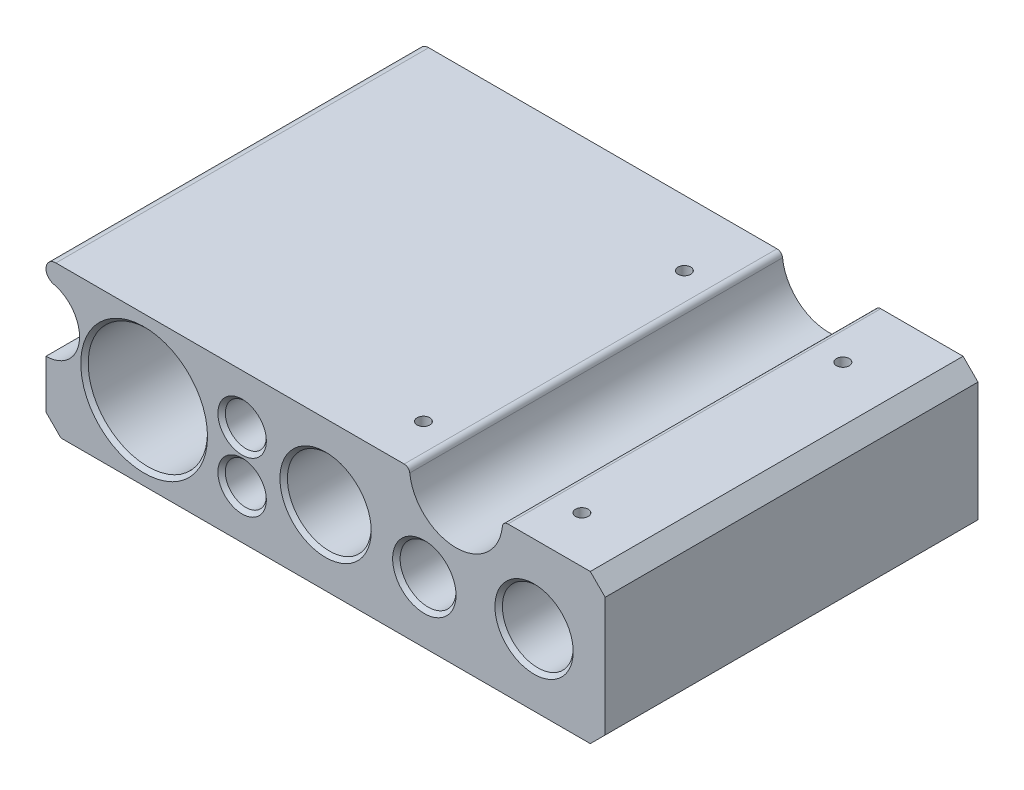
ISO-10303-21;
HEADER;
FILE_DESCRIPTION(('STEP AP214'),'2;1');
FILE_NAME('part.step','',(''),(''),'','','');
FILE_SCHEMA(('AUTOMOTIVE_DESIGN { 1 0 10303 214 1 1 1 1 }'));
ENDSEC;
DATA;
#1=APPLICATION_CONTEXT('core data for automotive mechanical design processes');
#2=APPLICATION_PROTOCOL_DEFINITION('international standard','automotive_design',2000,#1);
#3=PRODUCT_CONTEXT('',#1,'mechanical');
#4=PRODUCT('Part','Part','',(#3));
#5=PRODUCT_RELATED_PRODUCT_CATEGORY('part','',(#4));
#6=PRODUCT_DEFINITION_FORMATION('','',#4);
#7=PRODUCT_DEFINITION_CONTEXT('part definition',#1,'design');
#8=PRODUCT_DEFINITION('design','',#6,#7);
#9=PRODUCT_DEFINITION_SHAPE('','',#8);
#10=(LENGTH_UNIT() NAMED_UNIT(*) SI_UNIT(.MILLI.,.METRE.));
#11=(NAMED_UNIT(*) PLANE_ANGLE_UNIT() SI_UNIT($,.RADIAN.));
#12=(NAMED_UNIT(*) SI_UNIT($,.STERADIAN.) SOLID_ANGLE_UNIT());
#13=UNCERTAINTY_MEASURE_WITH_UNIT(LENGTH_MEASURE(1.E-05),#10,'distance_accuracy_value','');
#14=(GEOMETRIC_REPRESENTATION_CONTEXT(3) GLOBAL_UNCERTAINTY_ASSIGNED_CONTEXT((#13)) GLOBAL_UNIT_ASSIGNED_CONTEXT((#10,
#11,#12)) REPRESENTATION_CONTEXT('',''));
#15=CARTESIAN_POINT('',(0.,0.,0.));
#16=DIRECTION('',(0.,0.,1.));
#17=DIRECTION('',(1.,0.,0.));
#18=AXIS2_PLACEMENT_3D('',#15,#16,#17);
#19=CARTESIAN_POINT('',(-145.901987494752,29.5273013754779,120.));
#20=CARTESIAN_POINT('',(-145.901987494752,29.5273013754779,113.333333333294));
#21=CARTESIAN_POINT('',(-145.901987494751,29.5273013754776,106.66666666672));
#22=CARTESIAN_POINT('',(-145.901987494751,29.5273013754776,33.333333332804));
#23=CARTESIAN_POINT('',(-145.901987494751,29.5273013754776,-33.3333333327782));
#24=CARTESIAN_POINT('',(-145.901987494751,29.5273013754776,-106.666666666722));
#25=CARTESIAN_POINT('',(-145.901987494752,29.5273013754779,-113.333333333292));
#26=CARTESIAN_POINT('',(-145.901987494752,29.5273013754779,-120.));
#27=CARTESIAN_POINT('',(-154.2533414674,31.479909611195,120.));
#28=CARTESIAN_POINT('',(-154.2533414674,31.479909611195,113.333333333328));
#29=CARTESIAN_POINT('',(-154.253341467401,31.4799096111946,106.666666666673));
#30=CARTESIAN_POINT('',(-154.253341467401,31.4799096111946,33.3333333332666));
#31=CARTESIAN_POINT('',(-154.253341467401,31.4799096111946,-33.3333333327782));
#32=CARTESIAN_POINT('',(-154.253341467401,31.4799096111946,-106.666666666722));
#33=CARTESIAN_POINT('',(-154.2533414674,31.479909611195,-113.333333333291));
#34=CARTESIAN_POINT('',(-154.2533414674,31.479909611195,-120.));
#35=CARTESIAN_POINT('',(-153.270563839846,40.0000000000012,120.));
#36=CARTESIAN_POINT('',(-153.270563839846,40.0000000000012,113.333333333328));
#37=CARTESIAN_POINT('',(-153.270563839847,40.000000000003,106.666666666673));
#38=CARTESIAN_POINT('',(-153.270563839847,40.000000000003,33.3333333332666));
#39=CARTESIAN_POINT('',(-153.270563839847,40.000000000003,-33.3333333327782));
#40=CARTESIAN_POINT('',(-153.270563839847,40.000000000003,-106.666666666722));
#41=CARTESIAN_POINT('',(-153.270563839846,40.0000000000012,-113.333333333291));
#42=CARTESIAN_POINT('',(-153.270563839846,40.0000000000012,-120.));
#43=CARTESIAN_POINT('',(-144.69397989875,40.,120.));
#44=CARTESIAN_POINT('',(-144.69397989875,40.,113.333333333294));
#45=CARTESIAN_POINT('',(-144.693979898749,40.,106.66666666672));
#46=CARTESIAN_POINT('',(-144.693979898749,40.,33.333333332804));
#47=CARTESIAN_POINT('',(-144.693979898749,40.,-33.3333333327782));
#48=CARTESIAN_POINT('',(-144.693979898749,40.,-106.666666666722));
#49=CARTESIAN_POINT('',(-144.69397989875,40.,-113.333333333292));
#50=CARTESIAN_POINT('',(-144.69397989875,40.,-120.));
#51=(BOUNDED_SURFACE() B_SPLINE_SURFACE(3,3,((#19,#20,#21,#22,#23,#24,#25,#26),(#27,#28,#29,#30,
#31,#32,#33,#34),(#35,#36,#37,#38,#39,#40,#41,#42),(#43,#44,#45,#46,#47,#48,#49,#50)),
.UNSPECIFIED.,.F.,.F.,.F.) B_SPLINE_SURFACE_WITH_KNOTS((4,4),(4,2,2,4),(0.,1.),(-0.1,0.,1.,1.1),
.UNSPECIFIED.) GEOMETRIC_REPRESENTATION_ITEM() RATIONAL_B_SPLINE_SURFACE(((1.,1.,1.,1.,1.,1.,1.,
1.),(0.409725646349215,0.409725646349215,0.409725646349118,0.409725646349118,0.409725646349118,
0.409725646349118,0.409725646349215,0.409725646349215),(0.409725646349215,0.409725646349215,
0.409725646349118,0.409725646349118,0.409725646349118,0.409725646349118,0.409725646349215,
0.409725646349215),(1.,1.,1.,1.,1.,1.,1.,1.))) REPRESENTATION_ITEM('') SURFACE());
#52=CARTESIAN_POINT('',(-145.901987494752,29.5273013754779,-120.));
#53=CARTESIAN_POINT('',(-145.901987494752,29.5273013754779,-113.333333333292));
#54=CARTESIAN_POINT('',(-145.901987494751,29.5273013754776,-106.666666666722));
#55=CARTESIAN_POINT('',(-145.901987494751,29.5273013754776,-33.3333333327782));
#56=CARTESIAN_POINT('',(-145.901987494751,29.5273013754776,33.333333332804));
#57=CARTESIAN_POINT('',(-145.901987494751,29.5273013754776,106.66666666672));
#58=CARTESIAN_POINT('',(-145.901987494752,29.5273013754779,113.333333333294));
#59=CARTESIAN_POINT('',(-145.901987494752,29.5273013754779,120.));
#60=(BOUNDED_CURVE() B_SPLINE_CURVE(3,(#52,#53,#54,#55,#56,#57,#58,#59),.UNSPECIFIED.,.F.,
.F.) B_SPLINE_CURVE_WITH_KNOTS((4,2,2,4),(-0.1,0.,1.,1.1),
.UNSPECIFIED.) CURVE() GEOMETRIC_REPRESENTATION_ITEM() RATIONAL_B_SPLINE_CURVE((1.,1.,1.,1.,1.,
1.,1.,1.)) REPRESENTATION_ITEM(''));
#61=CARTESIAN_POINT('',(-145.901987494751,29.5273013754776,100.));
#62=VERTEX_POINT('',#61);
#63=CARTESIAN_POINT('',(-145.901987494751,29.5273013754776,-100.));
#64=VERTEX_POINT('',#63);
#65=EDGE_CURVE('E251',#62,#64,#60,.F.);
#66=CARTESIAN_POINT('',(-145.901987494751,29.5273013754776,100.));
#67=CARTESIAN_POINT('',(-154.253341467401,31.4799096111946,100.));
#68=CARTESIAN_POINT('',(-153.270563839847,40.000000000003,100.));
#69=CARTESIAN_POINT('',(-144.693979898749,40.,100.));
#70=(BOUNDED_CURVE() B_SPLINE_CURVE(3,(#66,#67,#68,#69),.UNSPECIFIED.,.F.,
.F.) B_SPLINE_CURVE_WITH_KNOTS((4,4),(0.,1.),
.UNSPECIFIED.) CURVE() GEOMETRIC_REPRESENTATION_ITEM() RATIONAL_B_SPLINE_CURVE((1.,
0.409725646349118,0.409725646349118,1.)) REPRESENTATION_ITEM(''));
#71=CARTESIAN_POINT('',(-144.693979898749,40.,100.));
#72=VERTEX_POINT('',#71);
#73=EDGE_CURVE('E287',#72,#62,#70,.F.);
#74=CARTESIAN_POINT('',(-144.69397989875,40.,120.));
#75=CARTESIAN_POINT('',(-144.69397989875,40.,113.333333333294));
#76=CARTESIAN_POINT('',(-144.693979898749,40.,106.66666666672));
#77=CARTESIAN_POINT('',(-144.693979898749,40.,33.333333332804));
#78=CARTESIAN_POINT('',(-144.693979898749,40.,-33.3333333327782));
#79=CARTESIAN_POINT('',(-144.693979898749,40.,-106.666666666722));
#80=CARTESIAN_POINT('',(-144.69397989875,40.,-113.333333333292));
#81=CARTESIAN_POINT('',(-144.69397989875,40.,-120.));
#82=(BOUNDED_CURVE() B_SPLINE_CURVE(3,(#74,#75,#76,#77,#78,#79,#80,#81),.UNSPECIFIED.,.F.,
.F.) B_SPLINE_CURVE_WITH_KNOTS((4,2,2,4),(-0.1,0.,1.,1.1),
.UNSPECIFIED.) CURVE() GEOMETRIC_REPRESENTATION_ITEM() RATIONAL_B_SPLINE_CURVE((1.,1.,1.,1.,1.,
1.,1.,1.)) REPRESENTATION_ITEM(''));
#83=CARTESIAN_POINT('',(-144.693979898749,40.,-100.));
#84=VERTEX_POINT('',#83);
#85=EDGE_CURVE('E506',#84,#72,#82,.F.);
#86=CARTESIAN_POINT('',(-144.693979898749,40.,-100.));
#87=CARTESIAN_POINT('',(-153.270563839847,40.000000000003,-100.));
#88=CARTESIAN_POINT('',(-154.253341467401,31.4799096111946,-100.));
#89=CARTESIAN_POINT('',(-145.901987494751,29.5273013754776,-100.));
#90=(BOUNDED_CURVE() B_SPLINE_CURVE(3,(#86,#87,#88,#89),.UNSPECIFIED.,.F.,
.F.) B_SPLINE_CURVE_WITH_KNOTS((4,4),(0.,1.),
.UNSPECIFIED.) CURVE() GEOMETRIC_REPRESENTATION_ITEM() RATIONAL_B_SPLINE_CURVE((1.,
0.409725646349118,0.409725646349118,1.)) REPRESENTATION_ITEM(''));
#91=EDGE_CURVE('E362',#64,#84,#90,.F.);
#92=ORIENTED_EDGE('',*,*,#65,.F.);
#93=ORIENTED_EDGE('',*,*,#73,.F.);
#94=ORIENTED_EDGE('',*,*,#85,.F.);
#95=ORIENTED_EDGE('',*,*,#91,.F.);
#96=EDGE_LOOP('',(#92,#93,#94,#95));
#97=FACE_BOUND('',#96,.T.);
#98=ADVANCED_FACE('F43',(#97),#51,.T.);
#99=CARTESIAN_POINT('',(-150.,12.,100.));
#100=DIRECTION('',(0.,0.,1.));
#101=DIRECTION('',(1.,0.,0.));
#102=AXIS2_PLACEMENT_3D('',#99,#100,#101);
#103=PLANE('',#102);
#104=CARTESIAN_POINT('',(111.835569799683,-1.8355697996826,100.));
#105=DIRECTION('',(0.,0.,1.));
#106=DIRECTION('',(1.,0.,0.));
#107=AXIS2_PLACEMENT_3D('',#104,#105,#106);
#108=CIRCLE('',#107,21.);
#109=CARTESIAN_POINT('',(132.835569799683,-1.8355697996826,100.));
#110=VERTEX_POINT('',#109);
#111=EDGE_CURVE('E438',#110,#110,#108,.F.);
#112=ORIENTED_EDGE('',*,*,#111,.T.);
#113=EDGE_LOOP('',(#112));
#114=FACE_BOUND('',#113,.T.);
#115=CARTESIAN_POINT('',(52.9669446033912,-7.06407255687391,100.));
#116=DIRECTION('',(0.,0.,1.));
#117=DIRECTION('',(1.,0.,0.));
#118=AXIS2_PLACEMENT_3D('',#115,#116,#117);
#119=CIRCLE('',#118,17.0000000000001);
#120=CARTESIAN_POINT('',(69.9669446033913,-7.06407255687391,100.));
#121=VERTEX_POINT('',#120);
#122=EDGE_CURVE('E435',#121,#121,#119,.F.);
#123=ORIENTED_EDGE('',*,*,#122,.T.);
#124=EDGE_LOOP('',(#123));
#125=FACE_BOUND('',#124,.T.);
#126=CARTESIAN_POINT('',(0.,0.,100.));
#127=DIRECTION('',(0.,0.,1.));
#128=DIRECTION('',(1.,0.,0.));
#129=AXIS2_PLACEMENT_3D('',#126,#127,#128);
#130=CIRCLE('',#129,24.5);
#131=CARTESIAN_POINT('',(24.4999999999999,0.,100.));
#132=VERTEX_POINT('',#131);
#133=EDGE_CURVE('E432',#132,#132,#130,.F.);
#134=ORIENTED_EDGE('',*,*,#133,.T.);
#135=EDGE_LOOP('',(#134));
#136=FACE_BOUND('',#135,.T.);
#137=CARTESIAN_POINT('',(-44.7790012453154,13.678438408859,100.));
#138=DIRECTION('',(0.,0.,1.));
#139=DIRECTION('',(1.,0.,0.));
#140=AXIS2_PLACEMENT_3D('',#137,#138,#139);
#141=CIRCLE('',#140,13.);
#142=CARTESIAN_POINT('',(-31.7790012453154,13.678438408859,100.));
#143=VERTEX_POINT('',#142);
#144=EDGE_CURVE('E429',#143,#143,#141,.F.);
#145=ORIENTED_EDGE('',*,*,#144,.T.);
#146=EDGE_LOOP('',(#145));
#147=FACE_BOUND('',#146,.T.);
#148=CARTESIAN_POINT('',(-44.7790012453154,-13.6784384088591,100.));
#149=DIRECTION('',(0.,0.,1.));
#150=DIRECTION('',(1.,0.,0.));
#151=AXIS2_PLACEMENT_3D('',#148,#149,#150);
#152=CIRCLE('',#151,13.);
#153=CARTESIAN_POINT('',(-31.7790012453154,-13.6784384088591,100.));
#154=VERTEX_POINT('',#153);
#155=EDGE_CURVE('E426',#154,#154,#152,.F.);
#156=ORIENTED_EDGE('',*,*,#155,.T.);
#157=EDGE_LOOP('',(#156));
#158=FACE_BOUND('',#157,.T.);
#159=CARTESIAN_POINT('',(-97.3502136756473,0.,100.));
#160=DIRECTION('',(0.,0.,1.));
#161=DIRECTION('',(1.,0.,0.));
#162=AXIS2_PLACEMENT_3D('',#159,#160,#161);
#163=CIRCLE('',#162,34.0000000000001);
#164=CARTESIAN_POINT('',(-63.3502136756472,0.,100.));
#165=VERTEX_POINT('',#164);
#166=EDGE_CURVE('E423',#165,#165,#163,.F.);
#167=ORIENTED_EDGE('',*,*,#166,.T.);
#168=EDGE_LOOP('',(#167));
#169=FACE_BOUND('',#168,.T.);
#170=DIRECTION('',(-1.,0.,0.));
#171=VECTOR('',#170,1.);
#172=CARTESIAN_POINT('',(95.,40.,100.));
#173=LINE('',#172,#171);
#174=CARTESIAN_POINT('',(142.,40.,100.));
#175=VERTEX_POINT('',#174);
#176=CARTESIAN_POINT('',(97.8388218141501,40.,100.));
#177=VERTEX_POINT('',#176);
#178=EDGE_CURVE('E188',#175,#177,#173,.T.);
#179=ORIENTED_EDGE('',*,*,#178,.T.);
#180=CARTESIAN_POINT('',(97.8388218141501,37.,100.));
#181=DIRECTION('',(0.,0.,1.));
#182=DIRECTION('',(1.,0.,0.));
#183=AXIS2_PLACEMENT_3D('',#180,#181,#182);
#184=CIRCLE('',#183,3.);
#185=CARTESIAN_POINT('',(94.8560909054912,37.3214285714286,100.));
#186=VERTEX_POINT('',#185);
#187=EDGE_CURVE('E51',#177,#186,#184,.T.);
#188=ORIENTED_EDGE('',*,*,#187,.T.);
#189=CARTESIAN_POINT('',(70.,40.,100.));
#190=DIRECTION('',(0.,0.,-1.));
#191=DIRECTION('',(1.,0.,0.));
#192=AXIS2_PLACEMENT_3D('',#189,#190,#191);
#193=CIRCLE('',#192,25.);
#194=CARTESIAN_POINT('',(45.1439090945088,37.3214285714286,100.));
#195=VERTEX_POINT('',#194);
#196=EDGE_CURVE('E191',#186,#195,#193,.T.);
#197=ORIENTED_EDGE('',*,*,#196,.T.);
#198=CARTESIAN_POINT('',(42.1611781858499,37.,100.));
#199=DIRECTION('',(0.,0.,1.));
#200=DIRECTION('',(1.,0.,0.));
#201=AXIS2_PLACEMENT_3D('',#198,#199,#200);
#202=CIRCLE('',#201,3.);
#203=CARTESIAN_POINT('',(42.1611781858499,40.,100.));
#204=VERTEX_POINT('',#203);
#205=EDGE_CURVE('E58',#195,#204,#202,.T.);
#206=ORIENTED_EDGE('',*,*,#205,.T.);
#207=DIRECTION('',(-1.,0.,0.));
#208=VECTOR('',#207,1.);
#209=CARTESIAN_POINT('',(-150.,40.,100.));
#210=LINE('',#209,#208);
#211=EDGE_CURVE('E193',#204,#72,#210,.T.);
#212=ORIENTED_EDGE('',*,*,#211,.T.);
#213=ORIENTED_EDGE('',*,*,#73,.T.);
#214=CARTESIAN_POINT('',(-150.,12.,100.));
#215=DIRECTION('',(0.,0.,-1.));
#216=DIRECTION('',(1.,0.,0.));
#217=AXIS2_PLACEMENT_3D('',#214,#215,#216);
#218=CIRCLE('',#217,18.);
#219=CARTESIAN_POINT('',(-150.,-5.99999999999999,100.));
#220=VERTEX_POINT('',#219);
#221=EDGE_CURVE('E201',#62,#220,#218,.T.);
#222=ORIENTED_EDGE('',*,*,#221,.T.);
#223=DIRECTION('',(0.,-1.,0.));
#224=VECTOR('',#223,1.);
#225=CARTESIAN_POINT('',(-150.,-5.99999999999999,100.));
#226=LINE('',#225,#224);
#227=CARTESIAN_POINT('',(-150.,-31.9999999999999,100.));
#228=VERTEX_POINT('',#227);
#229=EDGE_CURVE('E245',#220,#228,#226,.T.);
#230=ORIENTED_EDGE('',*,*,#229,.T.);
#231=DIRECTION('',(-0.707106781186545,0.70710678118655,0.));
#232=VECTOR('',#231,1.);
#233=CARTESIAN_POINT('',(-172.,-9.99999999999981,100.));
#234=LINE('',#233,#232);
#235=CARTESIAN_POINT('',(-142.,-40.,100.));
#236=VERTEX_POINT('',#235);
#237=EDGE_CURVE('E388',#228,#236,#234,.F.);
#238=ORIENTED_EDGE('',*,*,#237,.T.);
#239=DIRECTION('',(1.,0.,0.));
#240=VECTOR('',#239,1.);
#241=CARTESIAN_POINT('',(-150.,-40.,100.));
#242=LINE('',#241,#240);
#243=CARTESIAN_POINT('',(142.,-40.,100.));
#244=VERTEX_POINT('',#243);
#245=EDGE_CURVE('E487',#236,#244,#242,.T.);
#246=ORIENTED_EDGE('',*,*,#245,.T.);
#247=DIRECTION('',(-0.70710678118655,-0.707106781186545,0.));
#248=VECTOR('',#247,1.);
#249=CARTESIAN_POINT('',(21.999999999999,-160.,100.));
#250=LINE('',#249,#248);
#251=CARTESIAN_POINT('',(150.,-32.,100.));
#252=VERTEX_POINT('',#251);
#253=EDGE_CURVE('E386',#244,#252,#250,.F.);
#254=ORIENTED_EDGE('',*,*,#253,.T.);
#255=DIRECTION('',(0.,1.,0.));
#256=VECTOR('',#255,1.);
#257=CARTESIAN_POINT('',(150.,40.,100.));
#258=LINE('',#257,#256);
#259=CARTESIAN_POINT('',(150.,31.9999999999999,100.));
#260=VERTEX_POINT('',#259);
#261=EDGE_CURVE('E185',#252,#260,#258,.T.);
#262=ORIENTED_EDGE('',*,*,#261,.T.);
#263=DIRECTION('',(0.707106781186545,-0.70710678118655,0.));
#264=VECTOR('',#263,1.);
#265=CARTESIAN_POINT('',(10.000000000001,172.,100.));
#266=LINE('',#265,#264);
#267=EDGE_CURVE('E384',#260,#175,#266,.F.);
#268=ORIENTED_EDGE('',*,*,#267,.T.);
#269=EDGE_LOOP('',(#179,#188,#197,#206,#212,#213,#222,#230,#238,#246,#254,#262,#268));
#270=FACE_BOUND('',#269,.T.);
#271=ADVANCED_FACE('F205',(#114,#125,#136,#147,#158,#169,#270),#103,.T.);
#272=CARTESIAN_POINT('',(-150.,12.,-100.));
#273=DIRECTION('',(0.,0.,1.));
#274=DIRECTION('',(1.,0.,0.));
#275=AXIS2_PLACEMENT_3D('',#272,#273,#274);
#276=PLANE('',#275);
#277=CARTESIAN_POINT('',(111.835569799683,-1.8355697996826,-100.));
#278=DIRECTION('',(0.,0.,1.));
#279=DIRECTION('',(1.,0.,0.));
#280=AXIS2_PLACEMENT_3D('',#277,#278,#279);
#281=CIRCLE('',#280,21.);
#282=CARTESIAN_POINT('',(132.835569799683,-1.8355697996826,-100.));
#283=VERTEX_POINT('',#282);
#284=EDGE_CURVE('E414',#283,#283,#281,.T.);
#285=ORIENTED_EDGE('',*,*,#284,.T.);
#286=EDGE_LOOP('',(#285));
#287=FACE_BOUND('',#286,.T.);
#288=CARTESIAN_POINT('',(52.9669446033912,-7.06407255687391,-100.));
#289=DIRECTION('',(0.,0.,1.));
#290=DIRECTION('',(1.,0.,0.));
#291=AXIS2_PLACEMENT_3D('',#288,#289,#290);
#292=CIRCLE('',#291,16.9999999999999);
#293=CARTESIAN_POINT('',(69.9669446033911,-7.06407255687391,-100.));
#294=VERTEX_POINT('',#293);
#295=EDGE_CURVE('E410',#294,#294,#292,.T.);
#296=ORIENTED_EDGE('',*,*,#295,.T.);
#297=EDGE_LOOP('',(#296));
#298=FACE_BOUND('',#297,.T.);
#299=CARTESIAN_POINT('',(0.,0.,-100.));
#300=DIRECTION('',(0.,0.,1.));
#301=DIRECTION('',(1.,0.,0.));
#302=AXIS2_PLACEMENT_3D('',#299,#300,#301);
#303=CIRCLE('',#302,24.5);
#304=CARTESIAN_POINT('',(24.5,0.,-100.));
#305=VERTEX_POINT('',#304);
#306=EDGE_CURVE('E407',#305,#305,#303,.T.);
#307=ORIENTED_EDGE('',*,*,#306,.T.);
#308=EDGE_LOOP('',(#307));
#309=FACE_BOUND('',#308,.T.);
#310=CARTESIAN_POINT('',(-44.7790012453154,13.678438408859,-100.));
#311=DIRECTION('',(0.,0.,1.));
#312=DIRECTION('',(1.,0.,0.));
#313=AXIS2_PLACEMENT_3D('',#310,#311,#312);
#314=CIRCLE('',#313,13.);
#315=CARTESIAN_POINT('',(-31.7790012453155,13.678438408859,-100.));
#316=VERTEX_POINT('',#315);
#317=EDGE_CURVE('E404',#316,#316,#314,.T.);
#318=ORIENTED_EDGE('',*,*,#317,.T.);
#319=EDGE_LOOP('',(#318));
#320=FACE_BOUND('',#319,.T.);
#321=CARTESIAN_POINT('',(-44.7790012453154,-13.6784384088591,-100.));
#322=DIRECTION('',(0.,0.,1.));
#323=DIRECTION('',(1.,0.,0.));
#324=AXIS2_PLACEMENT_3D('',#321,#322,#323);
#325=CIRCLE('',#324,13.);
#326=CARTESIAN_POINT('',(-31.7790012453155,-13.6784384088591,-100.));
#327=VERTEX_POINT('',#326);
#328=EDGE_CURVE('E401',#327,#327,#325,.T.);
#329=ORIENTED_EDGE('',*,*,#328,.T.);
#330=EDGE_LOOP('',(#329));
#331=FACE_BOUND('',#330,.T.);
#332=CARTESIAN_POINT('',(-97.3502136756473,0.,-100.));
#333=DIRECTION('',(0.,0.,1.));
#334=DIRECTION('',(1.,0.,0.));
#335=AXIS2_PLACEMENT_3D('',#332,#333,#334);
#336=CIRCLE('',#335,34.);
#337=CARTESIAN_POINT('',(-63.3502136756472,0.,-100.));
#338=VERTEX_POINT('',#337);
#339=EDGE_CURVE('E398',#338,#338,#336,.T.);
#340=ORIENTED_EDGE('',*,*,#339,.T.);
#341=EDGE_LOOP('',(#340));
#342=FACE_BOUND('',#341,.T.);
#343=CARTESIAN_POINT('',(70.,40.,-100.));
#344=DIRECTION('',(0.,0.,-1.));
#345=DIRECTION('',(1.,0.,0.));
#346=AXIS2_PLACEMENT_3D('',#343,#344,#345);
#347=CIRCLE('',#346,25.);
#348=CARTESIAN_POINT('',(94.8560909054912,37.3214285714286,-100.));
#349=VERTEX_POINT('',#348);
#350=CARTESIAN_POINT('',(45.1439090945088,37.3214285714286,-100.));
#351=VERTEX_POINT('',#350);
#352=EDGE_CURVE('E231',#349,#351,#347,.T.);
#353=ORIENTED_EDGE('',*,*,#352,.F.);
#354=CARTESIAN_POINT('',(97.8388218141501,37.,-100.));
#355=DIRECTION('',(0.,0.,1.));
#356=DIRECTION('',(1.,0.,0.));
#357=AXIS2_PLACEMENT_3D('',#354,#355,#356);
#358=CIRCLE('',#357,3.);
#359=CARTESIAN_POINT('',(97.8388218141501,40.,-100.));
#360=VERTEX_POINT('',#359);
#361=EDGE_CURVE('E217',#349,#360,#358,.F.);
#362=ORIENTED_EDGE('',*,*,#361,.T.);
#363=DIRECTION('',(-1.,0.,0.));
#364=VECTOR('',#363,1.);
#365=CARTESIAN_POINT('',(95.,40.,-100.));
#366=LINE('',#365,#364);
#367=CARTESIAN_POINT('',(142.,40.,-100.));
#368=VERTEX_POINT('',#367);
#369=EDGE_CURVE('E483',#368,#360,#366,.T.);
#370=ORIENTED_EDGE('',*,*,#369,.F.);
#371=DIRECTION('',(-0.707106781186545,0.70710678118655,0.));
#372=VECTOR('',#371,1.);
#373=CARTESIAN_POINT('',(142.,40.,-100.));
#374=LINE('',#373,#372);
#375=CARTESIAN_POINT('',(150.,31.9999999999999,-100.));
#376=VERTEX_POINT('',#375);
#377=EDGE_CURVE('E376',#368,#376,#374,.F.);
#378=ORIENTED_EDGE('',*,*,#377,.T.);
#379=DIRECTION('',(0.,1.,0.));
#380=VECTOR('',#379,1.);
#381=CARTESIAN_POINT('',(150.,40.,-100.));
#382=LINE('',#381,#380);
#383=CARTESIAN_POINT('',(150.,-32.,-100.));
#384=VERTEX_POINT('',#383);
#385=EDGE_CURVE('E184',#384,#376,#382,.T.);
#386=ORIENTED_EDGE('',*,*,#385,.F.);
#387=DIRECTION('',(0.70710678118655,0.707106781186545,0.));
#388=VECTOR('',#387,1.);
#389=CARTESIAN_POINT('',(150.,-32.,-100.));
#390=LINE('',#389,#388);
#391=CARTESIAN_POINT('',(142.,-40.,-100.));
#392=VERTEX_POINT('',#391);
#393=EDGE_CURVE('E378',#384,#392,#390,.F.);
#394=ORIENTED_EDGE('',*,*,#393,.T.);
#395=DIRECTION('',(1.,0.,0.));
#396=VECTOR('',#395,1.);
#397=CARTESIAN_POINT('',(-150.,-40.,-100.));
#398=LINE('',#397,#396);
#399=CARTESIAN_POINT('',(-142.,-40.,-100.));
#400=VERTEX_POINT('',#399);
#401=EDGE_CURVE('E189',#400,#392,#398,.T.);
#402=ORIENTED_EDGE('',*,*,#401,.F.);
#403=DIRECTION('',(0.707106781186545,-0.70710678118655,0.));
#404=VECTOR('',#403,1.);
#405=CARTESIAN_POINT('',(-142.,-40.,-100.));
#406=LINE('',#405,#404);
#407=CARTESIAN_POINT('',(-150.,-31.9999999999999,-100.));
#408=VERTEX_POINT('',#407);
#409=EDGE_CURVE('E380',#400,#408,#406,.F.);
#410=ORIENTED_EDGE('',*,*,#409,.T.);
#411=DIRECTION('',(0.,-1.,0.));
#412=VECTOR('',#411,1.);
#413=CARTESIAN_POINT('',(-150.,-5.99999999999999,-100.));
#414=LINE('',#413,#412);
#415=CARTESIAN_POINT('',(-150.,-5.99999999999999,-100.));
#416=VERTEX_POINT('',#415);
#417=EDGE_CURVE('E238',#416,#408,#414,.T.);
#418=ORIENTED_EDGE('',*,*,#417,.F.);
#419=CARTESIAN_POINT('',(-150.,12.,-100.));
#420=DIRECTION('',(0.,0.,-1.));
#421=DIRECTION('',(1.,0.,0.));
#422=AXIS2_PLACEMENT_3D('',#419,#420,#421);
#423=CIRCLE('',#422,18.);
#424=EDGE_CURVE('E230',#64,#416,#423,.T.);
#425=ORIENTED_EDGE('',*,*,#424,.F.);
#426=ORIENTED_EDGE('',*,*,#91,.T.);
#427=DIRECTION('',(-1.,0.,0.));
#428=VECTOR('',#427,1.);
#429=CARTESIAN_POINT('',(-150.,40.,-100.));
#430=LINE('',#429,#428);
#431=CARTESIAN_POINT('',(42.1611781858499,40.,-100.));
#432=VERTEX_POINT('',#431);
#433=EDGE_CURVE('E228',#432,#84,#430,.T.);
#434=ORIENTED_EDGE('',*,*,#433,.F.);
#435=CARTESIAN_POINT('',(42.1611781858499,37.,-100.));
#436=DIRECTION('',(0.,0.,1.));
#437=DIRECTION('',(1.,0.,0.));
#438=AXIS2_PLACEMENT_3D('',#435,#436,#437);
#439=CIRCLE('',#438,3.);
#440=EDGE_CURVE('E219',#432,#351,#439,.F.);
#441=ORIENTED_EDGE('',*,*,#440,.T.);
#442=EDGE_LOOP('',(#353,#362,#370,#378,#386,#394,#402,#410,#418,#425,#426,#434,#441));
#443=FACE_BOUND('',#442,.T.);
#444=ADVANCED_FACE('F303',(#287,#298,#309,#320,#331,#342,#443),#276,.F.);
#445=CARTESIAN_POINT('',(150.,40.,100.));
#446=DIRECTION('',(-1.,0.,0.));
#447=DIRECTION('',(0.,0.,1.));
#448=AXIS2_PLACEMENT_3D('',#445,#446,#447);
#449=PLANE('',#448);
#450=ORIENTED_EDGE('',*,*,#261,.F.);
#451=DIRECTION('',(0.,0.,-1.));
#452=VECTOR('',#451,1.);
#453=CARTESIAN_POINT('',(150.,-32.,100.));
#454=LINE('',#453,#452);
#455=EDGE_CURVE('E392',#252,#384,#454,.T.);
#456=ORIENTED_EDGE('',*,*,#455,.T.);
#457=ORIENTED_EDGE('',*,*,#385,.T.);
#458=DIRECTION('',(0.,0.,1.));
#459=VECTOR('',#458,1.);
#460=CARTESIAN_POINT('',(150.,31.9999999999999,100.));
#461=LINE('',#460,#459);
#462=EDGE_CURVE('E390',#376,#260,#461,.T.);
#463=ORIENTED_EDGE('',*,*,#462,.T.);
#464=EDGE_LOOP('',(#450,#456,#457,#463));
#465=FACE_BOUND('',#464,.T.);
#466=ADVANCED_FACE('F309',(#465),#449,.F.);
#467=CARTESIAN_POINT('',(95.,40.,100.));
#468=DIRECTION('',(0.,-1.,0.));
#469=DIRECTION('',(0.,0.,-1.));
#470=AXIS2_PLACEMENT_3D('',#467,#468,#469);
#471=PLANE('',#470);
#472=CARTESIAN_POINT('',(112.5,40.,75.));
#473=DIRECTION('',(0.,1.,0.));
#474=DIRECTION('',(0.,0.,1.));
#475=AXIS2_PLACEMENT_3D('',#472,#473,#474);
#476=CIRCLE('',#475,3.39999999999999);
#477=CARTESIAN_POINT('',(112.5,40.,78.4));
#478=VERTEX_POINT('',#477);
#479=EDGE_CURVE('E172',#478,#478,#476,.T.);
#480=ORIENTED_EDGE('',*,*,#479,.F.);
#481=EDGE_LOOP('',(#480));
#482=FACE_BOUND('',#481,.T.);
#483=CARTESIAN_POINT('',(112.5,40.,-65.));
#484=DIRECTION('',(0.,1.,0.));
#485=DIRECTION('',(0.,0.,1.));
#486=AXIS2_PLACEMENT_3D('',#483,#484,#485);
#487=CIRCLE('',#486,3.39999999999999);
#488=CARTESIAN_POINT('',(112.5,40.,-61.6));
#489=VERTEX_POINT('',#488);
#490=EDGE_CURVE('E178',#489,#489,#487,.T.);
#491=ORIENTED_EDGE('',*,*,#490,.F.);
#492=EDGE_LOOP('',(#491));
#493=FACE_BOUND('',#492,.T.);
#494=ORIENTED_EDGE('',*,*,#369,.T.);
#495=DIRECTION('',(0.,0.,-1.));
#496=VECTOR('',#495,1.);
#497=CARTESIAN_POINT('',(97.8388218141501,40.,100.));
#498=LINE('',#497,#496);
#499=EDGE_CURVE('E66',#360,#177,#498,.F.);
#500=ORIENTED_EDGE('',*,*,#499,.T.);
#501=ORIENTED_EDGE('',*,*,#178,.F.);
#502=DIRECTION('',(0.,0.,-1.));
#503=VECTOR('',#502,1.);
#504=CARTESIAN_POINT('',(142.,40.,100.));
#505=LINE('',#504,#503);
#506=EDGE_CURVE('E395',#175,#368,#505,.T.);
#507=ORIENTED_EDGE('',*,*,#506,.T.);
#508=EDGE_LOOP('',(#494,#500,#501,#507));
#509=FACE_BOUND('',#508,.T.);
#510=ADVANCED_FACE('F579',(#482,#493,#509),#471,.F.);
#511=CARTESIAN_POINT('',(70.,40.,100.));
#512=DIRECTION('',(0.,0.,-1.));
#513=DIRECTION('',(-1.,0.,0.));
#514=AXIS2_PLACEMENT_3D('',#511,#512,#513);
#515=CYLINDRICAL_SURFACE('',#514,25.);
#516=ORIENTED_EDGE('',*,*,#196,.F.);
#517=DIRECTION('',(0.,0.,-1.));
#518=VECTOR('',#517,1.);
#519=CARTESIAN_POINT('',(94.8560909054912,37.3214285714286,100.));
#520=LINE('',#519,#518);
#521=EDGE_CURVE('E212',#186,#349,#520,.T.);
#522=ORIENTED_EDGE('',*,*,#521,.T.);
#523=ORIENTED_EDGE('',*,*,#352,.T.);
#524=DIRECTION('',(0.,0.,-1.));
#525=VECTOR('',#524,1.);
#526=CARTESIAN_POINT('',(45.1439090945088,37.3214285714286,100.));
#527=LINE('',#526,#525);
#528=EDGE_CURVE('E215',#351,#195,#527,.F.);
#529=ORIENTED_EDGE('',*,*,#528,.T.);
#530=EDGE_LOOP('',(#516,#522,#523,#529));
#531=FACE_BOUND('',#530,.T.);
#532=ADVANCED_FACE('F210',(#531),#515,.F.);
#533=CARTESIAN_POINT('',(-150.,40.,100.));
#534=DIRECTION('',(0.,-1.,0.));
#535=DIRECTION('',(0.,0.,-1.));
#536=AXIS2_PLACEMENT_3D('',#533,#534,#535);
#537=PLANE('',#536);
#538=CARTESIAN_POINT('',(27.5,40.,75.));
#539=DIRECTION('',(0.,1.,0.));
#540=DIRECTION('',(0.,0.,1.));
#541=AXIS2_PLACEMENT_3D('',#538,#539,#540);
#542=CIRCLE('',#541,3.39999999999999);
#543=CARTESIAN_POINT('',(27.5,40.,78.4));
#544=VERTEX_POINT('',#543);
#545=EDGE_CURVE('E162',#544,#544,#542,.T.);
#546=ORIENTED_EDGE('',*,*,#545,.F.);
#547=EDGE_LOOP('',(#546));
#548=FACE_BOUND('',#547,.T.);
#549=CARTESIAN_POINT('',(27.5,40.,-65.));
#550=DIRECTION('',(0.,1.,0.));
#551=DIRECTION('',(0.,0.,1.));
#552=AXIS2_PLACEMENT_3D('',#549,#550,#551);
#553=CIRCLE('',#552,3.39999999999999);
#554=CARTESIAN_POINT('',(27.5,40.,-61.6));
#555=VERTEX_POINT('',#554);
#556=EDGE_CURVE('E161',#555,#555,#553,.T.);
#557=ORIENTED_EDGE('',*,*,#556,.F.);
#558=EDGE_LOOP('',(#557));
#559=FACE_BOUND('',#558,.T.);
#560=ORIENTED_EDGE('',*,*,#211,.F.);
#561=DIRECTION('',(0.,0.,-1.));
#562=VECTOR('',#561,1.);
#563=CARTESIAN_POINT('',(42.1611781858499,40.,100.));
#564=LINE('',#563,#562);
#565=EDGE_CURVE('E11',#204,#432,#564,.T.);
#566=ORIENTED_EDGE('',*,*,#565,.T.);
#567=ORIENTED_EDGE('',*,*,#433,.T.);
#568=ORIENTED_EDGE('',*,*,#85,.T.);
#569=EDGE_LOOP('',(#560,#566,#567,#568));
#570=FACE_BOUND('',#569,.T.);
#571=ADVANCED_FACE('F270',(#548,#559,#570),#537,.F.);
#572=CARTESIAN_POINT('',(-150.,12.,100.));
#573=DIRECTION('',(0.,0.,-1.));
#574=DIRECTION('',(-1.,0.,0.));
#575=AXIS2_PLACEMENT_3D('',#572,#573,#574);
#576=CYLINDRICAL_SURFACE('',#575,18.);
#577=ORIENTED_EDGE('',*,*,#221,.F.);
#578=ORIENTED_EDGE('',*,*,#65,.T.);
#579=ORIENTED_EDGE('',*,*,#424,.T.);
#580=DIRECTION('',(0.,0.,-1.));
#581=VECTOR('',#580,1.);
#582=CARTESIAN_POINT('',(-150.,-5.99999999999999,100.));
#583=LINE('',#582,#581);
#584=EDGE_CURVE('E243',#220,#416,#583,.T.);
#585=ORIENTED_EDGE('',*,*,#584,.F.);
#586=EDGE_LOOP('',(#577,#578,#579,#585));
#587=FACE_BOUND('',#586,.T.);
#588=ADVANCED_FACE('F259',(#587),#576,.F.);
#589=CARTESIAN_POINT('',(-150.,-5.99999999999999,100.));
#590=DIRECTION('',(1.,0.,0.));
#591=DIRECTION('',(0.,0.,-1.));
#592=AXIS2_PLACEMENT_3D('',#589,#590,#591);
#593=PLANE('',#592);
#594=ORIENTED_EDGE('',*,*,#417,.T.);
#595=DIRECTION('',(0.,0.,1.));
#596=VECTOR('',#595,1.);
#597=CARTESIAN_POINT('',(-150.,-31.9999999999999,100.));
#598=LINE('',#597,#596);
#599=EDGE_CURVE('E382',#408,#228,#598,.T.);
#600=ORIENTED_EDGE('',*,*,#599,.T.);
#601=ORIENTED_EDGE('',*,*,#229,.F.);
#602=ORIENTED_EDGE('',*,*,#584,.T.);
#603=EDGE_LOOP('',(#594,#600,#601,#602));
#604=FACE_BOUND('',#603,.T.);
#605=ADVANCED_FACE('F269',(#604),#593,.F.);
#606=CARTESIAN_POINT('',(-150.,-40.,100.));
#607=DIRECTION('',(0.,1.,0.));
#608=DIRECTION('',(0.,0.,1.));
#609=AXIS2_PLACEMENT_3D('',#606,#607,#608);
#610=PLANE('',#609);
#611=ORIENTED_EDGE('',*,*,#245,.F.);
#612=DIRECTION('',(0.,0.,-1.));
#613=VECTOR('',#612,1.);
#614=CARTESIAN_POINT('',(-142.,-40.,100.));
#615=LINE('',#614,#613);
#616=EDGE_CURVE('E373',#236,#400,#615,.T.);
#617=ORIENTED_EDGE('',*,*,#616,.T.);
#618=ORIENTED_EDGE('',*,*,#401,.T.);
#619=DIRECTION('',(0.,0.,1.));
#620=VECTOR('',#619,1.);
#621=CARTESIAN_POINT('',(142.,-40.,100.));
#622=LINE('',#621,#620);
#623=EDGE_CURVE('E366',#392,#244,#622,.T.);
#624=ORIENTED_EDGE('',*,*,#623,.T.);
#625=EDGE_LOOP('',(#611,#617,#618,#624));
#626=FACE_BOUND('',#625,.T.);
#627=ADVANCED_FACE('F311',(#626),#610,.F.);
#628=CARTESIAN_POINT('',(-97.3502136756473,0.,100.));
#629=DIRECTION('',(0.,0.,-1.));
#630=DIRECTION('',(-1.,0.,0.));
#631=AXIS2_PLACEMENT_3D('',#628,#629,#630);
#632=CYLINDRICAL_SURFACE('',#631,32.);
#633=CARTESIAN_POINT('',(-97.3502136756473,0.,-97.9999999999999));
#634=DIRECTION('',(0.,0.,1.));
#635=DIRECTION('',(1.,0.,0.));
#636=AXIS2_PLACEMENT_3D('',#633,#634,#635);
#637=CIRCLE('',#636,32.);
#638=CARTESIAN_POINT('',(-65.3502136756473,0.,-97.9999999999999));
#639=VERTEX_POINT('',#638);
#640=EDGE_CURVE('E224',#639,#639,#637,.F.);
#641=ORIENTED_EDGE('',*,*,#640,.T.);
#642=EDGE_LOOP('',(#641));
#643=FACE_BOUND('',#642,.T.);
#644=CARTESIAN_POINT('',(-97.3502136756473,0.,98.));
#645=DIRECTION('',(0.,0.,1.));
#646=DIRECTION('',(1.,0.,0.));
#647=AXIS2_PLACEMENT_3D('',#644,#645,#646);
#648=CIRCLE('',#647,32.);
#649=CARTESIAN_POINT('',(-65.3502136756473,0.,98.));
#650=VERTEX_POINT('',#649);
#651=EDGE_CURVE('E465',#650,#650,#648,.T.);
#652=ORIENTED_EDGE('',*,*,#651,.T.);
#653=EDGE_LOOP('',(#652));
#654=FACE_BOUND('',#653,.T.);
#655=ADVANCED_FACE('F305',(#643,#654),#632,.F.);
#656=CARTESIAN_POINT('',(0.,0.,100.));
#657=DIRECTION('',(0.,0.,-1.));
#658=DIRECTION('',(-1.,0.,0.));
#659=AXIS2_PLACEMENT_3D('',#656,#657,#658);
#660=CYLINDRICAL_SURFACE('',#659,22.5);
#661=CARTESIAN_POINT('',(0.,0.,-98.));
#662=DIRECTION('',(0.,0.,1.));
#663=DIRECTION('',(1.,0.,0.));
#664=AXIS2_PLACEMENT_3D('',#661,#662,#663);
#665=CIRCLE('',#664,22.5);
#666=CARTESIAN_POINT('',(22.5,0.,-98.));
#667=VERTEX_POINT('',#666);
#668=EDGE_CURVE('E450',#667,#667,#665,.F.);
#669=ORIENTED_EDGE('',*,*,#668,.T.);
#670=EDGE_LOOP('',(#669));
#671=FACE_BOUND('',#670,.T.);
#672=CARTESIAN_POINT('',(0.,0.,98.));
#673=DIRECTION('',(0.,0.,1.));
#674=DIRECTION('',(1.,0.,0.));
#675=AXIS2_PLACEMENT_3D('',#672,#673,#674);
#676=CIRCLE('',#675,22.5);
#677=CARTESIAN_POINT('',(22.5,0.,98.));
#678=VERTEX_POINT('',#677);
#679=EDGE_CURVE('E447',#678,#678,#676,.T.);
#680=ORIENTED_EDGE('',*,*,#679,.T.);
#681=EDGE_LOOP('',(#680));
#682=FACE_BOUND('',#681,.T.);
#683=ADVANCED_FACE('F620',(#671,#682),#660,.F.);
#684=CARTESIAN_POINT('',(-44.7790012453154,13.678438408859,100.));
#685=DIRECTION('',(0.,0.,-1.));
#686=DIRECTION('',(-1.,0.,0.));
#687=AXIS2_PLACEMENT_3D('',#684,#685,#686);
#688=CYLINDRICAL_SURFACE('',#687,11.);
#689=CARTESIAN_POINT('',(-44.7790012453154,13.678438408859,-98.));
#690=DIRECTION('',(0.,0.,1.));
#691=DIRECTION('',(1.,0.,0.));
#692=AXIS2_PLACEMENT_3D('',#689,#690,#691);
#693=CIRCLE('',#692,11.);
#694=CARTESIAN_POINT('',(-33.7790012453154,13.678438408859,-98.));
#695=VERTEX_POINT('',#694);
#696=EDGE_CURVE('E456',#695,#695,#693,.F.);
#697=ORIENTED_EDGE('',*,*,#696,.T.);
#698=EDGE_LOOP('',(#697));
#699=FACE_BOUND('',#698,.T.);
#700=CARTESIAN_POINT('',(-44.7790012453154,13.678438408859,98.));
#701=DIRECTION('',(0.,0.,1.));
#702=DIRECTION('',(1.,0.,0.));
#703=AXIS2_PLACEMENT_3D('',#700,#701,#702);
#704=CIRCLE('',#703,11.);
#705=CARTESIAN_POINT('',(-33.7790012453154,13.678438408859,98.));
#706=VERTEX_POINT('',#705);
#707=EDGE_CURVE('E453',#706,#706,#704,.T.);
#708=ORIENTED_EDGE('',*,*,#707,.T.);
#709=EDGE_LOOP('',(#708));
#710=FACE_BOUND('',#709,.T.);
#711=ADVANCED_FACE('F617',(#699,#710),#688,.F.);
#712=CARTESIAN_POINT('',(-44.7790012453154,-13.6784384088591,100.));
#713=DIRECTION('',(0.,0.,-1.));
#714=DIRECTION('',(-1.,0.,0.));
#715=AXIS2_PLACEMENT_3D('',#712,#713,#714);
#716=CYLINDRICAL_SURFACE('',#715,11.);
#717=CARTESIAN_POINT('',(-44.7790012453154,-13.6784384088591,-98.));
#718=DIRECTION('',(0.,0.,1.));
#719=DIRECTION('',(1.,0.,0.));
#720=AXIS2_PLACEMENT_3D('',#717,#718,#719);
#721=CIRCLE('',#720,11.);
#722=CARTESIAN_POINT('',(-33.7790012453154,-13.6784384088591,-98.));
#723=VERTEX_POINT('',#722);
#724=EDGE_CURVE('E462',#723,#723,#721,.F.);
#725=ORIENTED_EDGE('',*,*,#724,.T.);
#726=EDGE_LOOP('',(#725));
#727=FACE_BOUND('',#726,.T.);
#728=CARTESIAN_POINT('',(-44.7790012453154,-13.6784384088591,98.));
#729=DIRECTION('',(0.,0.,1.));
#730=DIRECTION('',(1.,0.,0.));
#731=AXIS2_PLACEMENT_3D('',#728,#729,#730);
#732=CIRCLE('',#731,11.);
#733=CARTESIAN_POINT('',(-33.7790012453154,-13.6784384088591,98.));
#734=VERTEX_POINT('',#733);
#735=EDGE_CURVE('E459',#734,#734,#732,.T.);
#736=ORIENTED_EDGE('',*,*,#735,.T.);
#737=EDGE_LOOP('',(#736));
#738=FACE_BOUND('',#737,.T.);
#739=ADVANCED_FACE('F613',(#727,#738),#716,.F.);
#740=CARTESIAN_POINT('',(52.9669446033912,-7.06407255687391,100.));
#741=DIRECTION('',(0.,0.,-1.));
#742=DIRECTION('',(-1.,0.,0.));
#743=AXIS2_PLACEMENT_3D('',#740,#741,#742);
#744=CYLINDRICAL_SURFACE('',#743,15.);
#745=CARTESIAN_POINT('',(52.9669446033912,-7.06407255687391,-98.0000000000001));
#746=DIRECTION('',(0.,0.,1.));
#747=DIRECTION('',(1.,0.,0.));
#748=AXIS2_PLACEMENT_3D('',#745,#746,#747);
#749=CIRCLE('',#748,15.);
#750=CARTESIAN_POINT('',(67.9669446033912,-7.06407255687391,-98.0000000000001));
#751=VERTEX_POINT('',#750);
#752=EDGE_CURVE('E444',#751,#751,#749,.F.);
#753=ORIENTED_EDGE('',*,*,#752,.T.);
#754=EDGE_LOOP('',(#753));
#755=FACE_BOUND('',#754,.T.);
#756=CARTESIAN_POINT('',(52.9669446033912,-7.06407255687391,97.9999999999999));
#757=DIRECTION('',(0.,0.,1.));
#758=DIRECTION('',(1.,0.,0.));
#759=AXIS2_PLACEMENT_3D('',#756,#757,#758);
#760=CIRCLE('',#759,15.);
#761=CARTESIAN_POINT('',(67.9669446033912,-7.06407255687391,97.9999999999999));
#762=VERTEX_POINT('',#761);
#763=EDGE_CURVE('E441',#762,#762,#760,.T.);
#764=ORIENTED_EDGE('',*,*,#763,.T.);
#765=EDGE_LOOP('',(#764));
#766=FACE_BOUND('',#765,.T.);
#767=ADVANCED_FACE('F609',(#755,#766),#744,.F.);
#768=CARTESIAN_POINT('',(111.835569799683,-1.8355697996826,100.));
#769=DIRECTION('',(0.,0.,-1.));
#770=DIRECTION('',(-1.,0.,0.));
#771=AXIS2_PLACEMENT_3D('',#768,#769,#770);
#772=CYLINDRICAL_SURFACE('',#771,19.);
#773=CARTESIAN_POINT('',(111.835569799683,-1.8355697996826,-98.));
#774=DIRECTION('',(0.,0.,1.));
#775=DIRECTION('',(1.,0.,0.));
#776=AXIS2_PLACEMENT_3D('',#773,#774,#775);
#777=CIRCLE('',#776,19.);
#778=CARTESIAN_POINT('',(130.835569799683,-1.8355697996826,-98.));
#779=VERTEX_POINT('',#778);
#780=EDGE_CURVE('E420',#779,#779,#777,.F.);
#781=ORIENTED_EDGE('',*,*,#780,.T.);
#782=EDGE_LOOP('',(#781));
#783=FACE_BOUND('',#782,.T.);
#784=CARTESIAN_POINT('',(111.835569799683,-1.8355697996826,97.9999999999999));
#785=DIRECTION('',(0.,0.,1.));
#786=DIRECTION('',(1.,0.,0.));
#787=AXIS2_PLACEMENT_3D('',#784,#785,#786);
#788=CIRCLE('',#787,19.);
#789=CARTESIAN_POINT('',(130.835569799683,-1.8355697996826,97.9999999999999));
#790=VERTEX_POINT('',#789);
#791=EDGE_CURVE('E417',#790,#790,#788,.T.);
#792=ORIENTED_EDGE('',*,*,#791,.T.);
#793=EDGE_LOOP('',(#792));
#794=FACE_BOUND('',#793,.T.);
#795=ADVANCED_FACE('F571',(#783,#794),#772,.F.);
#796=CARTESIAN_POINT('',(-142.,-40.,100.));
#797=DIRECTION('',(0.70710678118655,0.707106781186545,0.));
#798=DIRECTION('',(0.,0.,-1.));
#799=AXIS2_PLACEMENT_3D('',#796,#797,#798);
#800=PLANE('',#799);
#801=ORIENTED_EDGE('',*,*,#237,.F.);
#802=ORIENTED_EDGE('',*,*,#599,.F.);
#803=ORIENTED_EDGE('',*,*,#409,.F.);
#804=ORIENTED_EDGE('',*,*,#616,.F.);
#805=EDGE_LOOP('',(#801,#802,#803,#804));
#806=FACE_BOUND('',#805,.T.);
#807=ADVANCED_FACE('F339',(#806),#800,.F.);
#808=CARTESIAN_POINT('',(150.,-32.,100.));
#809=DIRECTION('',(-0.707106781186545,0.70710678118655,0.));
#810=DIRECTION('',(0.,0.,-1.));
#811=AXIS2_PLACEMENT_3D('',#808,#809,#810);
#812=PLANE('',#811);
#813=ORIENTED_EDGE('',*,*,#253,.F.);
#814=ORIENTED_EDGE('',*,*,#623,.F.);
#815=ORIENTED_EDGE('',*,*,#393,.F.);
#816=ORIENTED_EDGE('',*,*,#455,.F.);
#817=EDGE_LOOP('',(#813,#814,#815,#816));
#818=FACE_BOUND('',#817,.T.);
#819=ADVANCED_FACE('F564',(#818),#812,.F.);
#820=CARTESIAN_POINT('',(142.,40.,100.));
#821=DIRECTION('',(-0.70710678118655,-0.707106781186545,0.));
#822=DIRECTION('',(0.,0.,-1.));
#823=AXIS2_PLACEMENT_3D('',#820,#821,#822);
#824=PLANE('',#823);
#825=ORIENTED_EDGE('',*,*,#267,.F.);
#826=ORIENTED_EDGE('',*,*,#462,.F.);
#827=ORIENTED_EDGE('',*,*,#377,.F.);
#828=ORIENTED_EDGE('',*,*,#506,.F.);
#829=EDGE_LOOP('',(#825,#826,#827,#828));
#830=FACE_BOUND('',#829,.T.);
#831=ADVANCED_FACE('F561',(#830),#824,.F.);
#832=CARTESIAN_POINT('',(111.835569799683,-1.8355697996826,-100.));
#833=DIRECTION('',(0.,0.,-1.));
#834=DIRECTION('',(-1.,0.,0.));
#835=AXIS2_PLACEMENT_3D('',#832,#833,#834);
#836=CONICAL_SURFACE('',#835,21.,0.785398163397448);
#837=ORIENTED_EDGE('',*,*,#780,.F.);
#838=EDGE_LOOP('',(#837));
#839=FACE_BOUND('',#838,.T.);
#840=ORIENTED_EDGE('',*,*,#284,.F.);
#841=EDGE_LOOP('',(#840));
#842=FACE_BOUND('',#841,.T.);
#843=ADVANCED_FACE('F557',(#839,#842),#836,.F.);
#844=CARTESIAN_POINT('',(111.835569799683,-1.8355697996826,97.9999999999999));
#845=DIRECTION('',(0.,0.,1.));
#846=DIRECTION('',(1.,0.,0.));
#847=AXIS2_PLACEMENT_3D('',#844,#845,#846);
#848=CONICAL_SURFACE('',#847,19.,0.785398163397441);
#849=ORIENTED_EDGE('',*,*,#111,.F.);
#850=EDGE_LOOP('',(#849));
#851=FACE_BOUND('',#850,.T.);
#852=ORIENTED_EDGE('',*,*,#791,.F.);
#853=EDGE_LOOP('',(#852));
#854=FACE_BOUND('',#853,.T.);
#855=ADVANCED_FACE('F553',(#851,#854),#848,.F.);
#856=CARTESIAN_POINT('',(52.9669446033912,-7.06407255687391,-100.));
#857=DIRECTION('',(0.,0.,-1.));
#858=DIRECTION('',(-1.,0.,0.));
#859=AXIS2_PLACEMENT_3D('',#856,#857,#858);
#860=CONICAL_SURFACE('',#859,16.9999999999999,0.785398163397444);
#861=ORIENTED_EDGE('',*,*,#752,.F.);
#862=EDGE_LOOP('',(#861));
#863=FACE_BOUND('',#862,.T.);
#864=ORIENTED_EDGE('',*,*,#295,.F.);
#865=EDGE_LOOP('',(#864));
#866=FACE_BOUND('',#865,.T.);
#867=ADVANCED_FACE('F549',(#863,#866),#860,.F.);
#868=CARTESIAN_POINT('',(52.9669446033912,-7.06407255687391,97.9999999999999));
#869=DIRECTION('',(0.,0.,1.));
#870=DIRECTION('',(1.,0.,0.));
#871=AXIS2_PLACEMENT_3D('',#868,#869,#870);
#872=CONICAL_SURFACE('',#871,15.,0.785398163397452);
#873=ORIENTED_EDGE('',*,*,#122,.F.);
#874=EDGE_LOOP('',(#873));
#875=FACE_BOUND('',#874,.T.);
#876=ORIENTED_EDGE('',*,*,#763,.F.);
#877=EDGE_LOOP('',(#876));
#878=FACE_BOUND('',#877,.T.);
#879=ADVANCED_FACE('F545',(#875,#878),#872,.F.);
#880=CARTESIAN_POINT('',(0.,0.,-100.));
#881=DIRECTION('',(0.,0.,-1.));
#882=DIRECTION('',(-1.,0.,0.));
#883=AXIS2_PLACEMENT_3D('',#880,#881,#882);
#884=CONICAL_SURFACE('',#883,24.5,0.785398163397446);
#885=ORIENTED_EDGE('',*,*,#668,.F.);
#886=EDGE_LOOP('',(#885));
#887=FACE_BOUND('',#886,.T.);
#888=ORIENTED_EDGE('',*,*,#306,.F.);
#889=EDGE_LOOP('',(#888));
#890=FACE_BOUND('',#889,.T.);
#891=ADVANCED_FACE('F541',(#887,#890),#884,.F.);
#892=CARTESIAN_POINT('',(0.,0.,98.));
#893=DIRECTION('',(0.,0.,1.));
#894=DIRECTION('',(1.,0.,0.));
#895=AXIS2_PLACEMENT_3D('',#892,#893,#894);
#896=CONICAL_SURFACE('',#895,22.5,0.785398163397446);
#897=ORIENTED_EDGE('',*,*,#133,.F.);
#898=EDGE_LOOP('',(#897));
#899=FACE_BOUND('',#898,.T.);
#900=ORIENTED_EDGE('',*,*,#679,.F.);
#901=EDGE_LOOP('',(#900));
#902=FACE_BOUND('',#901,.T.);
#903=ADVANCED_FACE('F537',(#899,#902),#896,.F.);
#904=CARTESIAN_POINT('',(-44.7790012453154,13.678438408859,-100.));
#905=DIRECTION('',(0.,0.,-1.));
#906=DIRECTION('',(-1.,0.,0.));
#907=AXIS2_PLACEMENT_3D('',#904,#905,#906);
#908=CONICAL_SURFACE('',#907,13.,0.785398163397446);
#909=ORIENTED_EDGE('',*,*,#696,.F.);
#910=EDGE_LOOP('',(#909));
#911=FACE_BOUND('',#910,.T.);
#912=ORIENTED_EDGE('',*,*,#317,.F.);
#913=EDGE_LOOP('',(#912));
#914=FACE_BOUND('',#913,.T.);
#915=ADVANCED_FACE('F533',(#911,#914),#908,.F.);
#916=CARTESIAN_POINT('',(-44.7790012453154,13.678438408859,98.));
#917=DIRECTION('',(0.,0.,1.));
#918=DIRECTION('',(1.,0.,0.));
#919=AXIS2_PLACEMENT_3D('',#916,#917,#918);
#920=CONICAL_SURFACE('',#919,11.,0.785398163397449);
#921=ORIENTED_EDGE('',*,*,#144,.F.);
#922=EDGE_LOOP('',(#921));
#923=FACE_BOUND('',#922,.T.);
#924=ORIENTED_EDGE('',*,*,#707,.F.);
#925=EDGE_LOOP('',(#924));
#926=FACE_BOUND('',#925,.T.);
#927=ADVANCED_FACE('F529',(#923,#926),#920,.F.);
#928=CARTESIAN_POINT('',(-44.7790012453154,-13.6784384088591,-100.));
#929=DIRECTION('',(0.,0.,-1.));
#930=DIRECTION('',(-1.,0.,0.));
#931=AXIS2_PLACEMENT_3D('',#928,#929,#930);
#932=CONICAL_SURFACE('',#931,13.,0.785398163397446);
#933=ORIENTED_EDGE('',*,*,#724,.F.);
#934=EDGE_LOOP('',(#933));
#935=FACE_BOUND('',#934,.T.);
#936=ORIENTED_EDGE('',*,*,#328,.F.);
#937=EDGE_LOOP('',(#936));
#938=FACE_BOUND('',#937,.T.);
#939=ADVANCED_FACE('F525',(#935,#938),#932,.F.);
#940=CARTESIAN_POINT('',(-44.7790012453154,-13.6784384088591,98.));
#941=DIRECTION('',(0.,0.,1.));
#942=DIRECTION('',(1.,0.,0.));
#943=AXIS2_PLACEMENT_3D('',#940,#941,#942);
#944=CONICAL_SURFACE('',#943,11.,0.785398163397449);
#945=ORIENTED_EDGE('',*,*,#155,.F.);
#946=EDGE_LOOP('',(#945));
#947=FACE_BOUND('',#946,.T.);
#948=ORIENTED_EDGE('',*,*,#735,.F.);
#949=EDGE_LOOP('',(#948));
#950=FACE_BOUND('',#949,.T.);
#951=ADVANCED_FACE('F476',(#947,#950),#944,.F.);
#952=CARTESIAN_POINT('',(-97.3502136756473,0.,-100.));
#953=DIRECTION('',(0.,0.,-1.));
#954=DIRECTION('',(-1.,0.,0.));
#955=AXIS2_PLACEMENT_3D('',#952,#953,#954);
#956=CONICAL_SURFACE('',#955,34.,0.785398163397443);
#957=ORIENTED_EDGE('',*,*,#640,.F.);
#958=EDGE_LOOP('',(#957));
#959=FACE_BOUND('',#958,.T.);
#960=ORIENTED_EDGE('',*,*,#339,.F.);
#961=EDGE_LOOP('',(#960));
#962=FACE_BOUND('',#961,.T.);
#963=ADVANCED_FACE('F472',(#959,#962),#956,.F.);
#964=CARTESIAN_POINT('',(-97.3502136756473,0.,98.));
#965=DIRECTION('',(0.,0.,1.));
#966=DIRECTION('',(1.,0.,0.));
#967=AXIS2_PLACEMENT_3D('',#964,#965,#966);
#968=CONICAL_SURFACE('',#967,32.,0.785398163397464);
#969=ORIENTED_EDGE('',*,*,#166,.F.);
#970=EDGE_LOOP('',(#969));
#971=FACE_BOUND('',#970,.T.);
#972=ORIENTED_EDGE('',*,*,#651,.F.);
#973=EDGE_LOOP('',(#972));
#974=FACE_BOUND('',#973,.T.);
#975=ADVANCED_FACE('F475',(#971,#974),#968,.F.);
#976=CARTESIAN_POINT('',(112.5,20.25,-65.));
#977=DIRECTION('',(0.,1.,0.));
#978=DIRECTION('',(0.,0.,1.));
#979=AXIS2_PLACEMENT_3D('',#976,#977,#978);
#980=CONICAL_SURFACE('',#979,3.4,1.02974425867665);
#981=CARTESIAN_POINT('',(112.5,18.2070738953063,-65.));
#982=VERTEX_POINT('',#981);
#983=VERTEX_LOOP('',#982);
#984=FACE_BOUND('',#983,.T.);
#985=CARTESIAN_POINT('',(112.5,20.25,-65.));
#986=DIRECTION('',(0.,1.,0.));
#987=DIRECTION('',(0.,0.,1.));
#988=AXIS2_PLACEMENT_3D('',#985,#986,#987);
#989=CIRCLE('',#988,3.4);
#990=CARTESIAN_POINT('',(112.5,20.25,-61.6));
#991=VERTEX_POINT('',#990);
#992=EDGE_CURVE('E181',#991,#991,#989,.T.);
#993=ORIENTED_EDGE('',*,*,#992,.T.);
#994=EDGE_LOOP('',(#993));
#995=FACE_BOUND('',#994,.T.);
#996=ADVANCED_FACE('F520',(#984,#995),#980,.F.);
#997=CARTESIAN_POINT('',(112.5,40.,-65.));
#998=DIRECTION('',(0.,1.,0.));
#999=DIRECTION('',(0.,0.,1.));
#1000=AXIS2_PLACEMENT_3D('',#997,#998,#999);
#1001=CYLINDRICAL_SURFACE('',#1000,3.39999999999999);
#1002=ORIENTED_EDGE('',*,*,#992,.F.);
#1003=EDGE_LOOP('',(#1002));
#1004=FACE_BOUND('',#1003,.T.);
#1005=ORIENTED_EDGE('',*,*,#490,.T.);
#1006=EDGE_LOOP('',(#1005));
#1007=FACE_BOUND('',#1006,.T.);
#1008=ADVANCED_FACE('F590',(#1004,#1007),#1001,.F.);
#1009=CARTESIAN_POINT('',(112.5,20.25,75.));
#1010=DIRECTION('',(0.,1.,0.));
#1011=DIRECTION('',(0.,0.,1.));
#1012=AXIS2_PLACEMENT_3D('',#1009,#1010,#1011);
#1013=CONICAL_SURFACE('',#1012,3.4,1.02974425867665);
#1014=CARTESIAN_POINT('',(112.5,18.2070738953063,75.));
#1015=VERTEX_POINT('',#1014);
#1016=VERTEX_LOOP('',#1015);
#1017=FACE_BOUND('',#1016,.T.);
#1018=CARTESIAN_POINT('',(112.5,20.25,75.));
#1019=DIRECTION('',(0.,1.,0.));
#1020=DIRECTION('',(0.,0.,1.));
#1021=AXIS2_PLACEMENT_3D('',#1018,#1019,#1020);
#1022=CIRCLE('',#1021,3.4);
#1023=CARTESIAN_POINT('',(112.5,20.25,78.4));
#1024=VERTEX_POINT('',#1023);
#1025=EDGE_CURVE('E175',#1024,#1024,#1022,.T.);
#1026=ORIENTED_EDGE('',*,*,#1025,.T.);
#1027=EDGE_LOOP('',(#1026));
#1028=FACE_BOUND('',#1027,.T.);
#1029=ADVANCED_FACE('F592',(#1017,#1028),#1013,.F.);
#1030=CARTESIAN_POINT('',(112.5,40.,75.));
#1031=DIRECTION('',(0.,1.,0.));
#1032=DIRECTION('',(0.,0.,1.));
#1033=AXIS2_PLACEMENT_3D('',#1030,#1031,#1032);
#1034=CYLINDRICAL_SURFACE('',#1033,3.39999999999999);
#1035=ORIENTED_EDGE('',*,*,#1025,.F.);
#1036=EDGE_LOOP('',(#1035));
#1037=FACE_BOUND('',#1036,.T.);
#1038=ORIENTED_EDGE('',*,*,#479,.T.);
#1039=EDGE_LOOP('',(#1038));
#1040=FACE_BOUND('',#1039,.T.);
#1041=ADVANCED_FACE('F599',(#1037,#1040),#1034,.F.);
#1042=CARTESIAN_POINT('',(27.5,20.25,-65.));
#1043=DIRECTION('',(0.,1.,0.));
#1044=DIRECTION('',(0.,0.,1.));
#1045=AXIS2_PLACEMENT_3D('',#1042,#1043,#1044);
#1046=CONICAL_SURFACE('',#1045,3.4,1.02974425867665);
#1047=CARTESIAN_POINT('',(27.5,18.2070738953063,-65.));
#1048=VERTEX_POINT('',#1047);
#1049=VERTEX_LOOP('',#1048);
#1050=FACE_BOUND('',#1049,.T.);
#1051=CARTESIAN_POINT('',(27.5,20.25,-65.));
#1052=DIRECTION('',(0.,1.,0.));
#1053=DIRECTION('',(0.,0.,1.));
#1054=AXIS2_PLACEMENT_3D('',#1051,#1052,#1053);
#1055=CIRCLE('',#1054,3.4);
#1056=CARTESIAN_POINT('',(27.5,20.25,-61.6));
#1057=VERTEX_POINT('',#1056);
#1058=EDGE_CURVE('E165',#1057,#1057,#1055,.T.);
#1059=ORIENTED_EDGE('',*,*,#1058,.T.);
#1060=EDGE_LOOP('',(#1059));
#1061=FACE_BOUND('',#1060,.T.);
#1062=ADVANCED_FACE('F824',(#1050,#1061),#1046,.F.);
#1063=CARTESIAN_POINT('',(27.5,40.,-65.));
#1064=DIRECTION('',(0.,1.,0.));
#1065=DIRECTION('',(0.,0.,1.));
#1066=AXIS2_PLACEMENT_3D('',#1063,#1064,#1065);
#1067=CYLINDRICAL_SURFACE('',#1066,3.39999999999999);
#1068=ORIENTED_EDGE('',*,*,#1058,.F.);
#1069=EDGE_LOOP('',(#1068));
#1070=FACE_BOUND('',#1069,.T.);
#1071=ORIENTED_EDGE('',*,*,#556,.T.);
#1072=EDGE_LOOP('',(#1071));
#1073=FACE_BOUND('',#1072,.T.);
#1074=ADVANCED_FACE('F155',(#1070,#1073),#1067,.F.);
#1075=CARTESIAN_POINT('',(27.5,20.25,75.));
#1076=DIRECTION('',(0.,1.,0.));
#1077=DIRECTION('',(0.,0.,1.));
#1078=AXIS2_PLACEMENT_3D('',#1075,#1076,#1077);
#1079=CONICAL_SURFACE('',#1078,3.4,1.02974425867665);
#1080=CARTESIAN_POINT('',(27.5,18.2070738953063,75.));
#1081=VERTEX_POINT('',#1080);
#1082=VERTEX_LOOP('',#1081);
#1083=FACE_BOUND('',#1082,.T.);
#1084=CARTESIAN_POINT('',(27.5,20.25,75.));
#1085=DIRECTION('',(0.,1.,0.));
#1086=DIRECTION('',(0.,0.,1.));
#1087=AXIS2_PLACEMENT_3D('',#1084,#1085,#1086);
#1088=CIRCLE('',#1087,3.4);
#1089=CARTESIAN_POINT('',(27.5,20.25,78.4));
#1090=VERTEX_POINT('',#1089);
#1091=EDGE_CURVE('E159',#1090,#1090,#1088,.T.);
#1092=ORIENTED_EDGE('',*,*,#1091,.T.);
#1093=EDGE_LOOP('',(#1092));
#1094=FACE_BOUND('',#1093,.T.);
#1095=ADVANCED_FACE('F151',(#1083,#1094),#1079,.F.);
#1096=CARTESIAN_POINT('',(27.5,40.,75.));
#1097=DIRECTION('',(0.,1.,0.));
#1098=DIRECTION('',(0.,0.,1.));
#1099=AXIS2_PLACEMENT_3D('',#1096,#1097,#1098);
#1100=CYLINDRICAL_SURFACE('',#1099,3.39999999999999);
#1101=ORIENTED_EDGE('',*,*,#1091,.F.);
#1102=EDGE_LOOP('',(#1101));
#1103=FACE_BOUND('',#1102,.T.);
#1104=ORIENTED_EDGE('',*,*,#545,.T.);
#1105=EDGE_LOOP('',(#1104));
#1106=FACE_BOUND('',#1105,.T.);
#1107=ADVANCED_FACE('F154',(#1103,#1106),#1100,.F.);
#1108=CARTESIAN_POINT('',(97.8388218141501,37.,100.));
#1109=DIRECTION('',(0.,0.,-1.));
#1110=DIRECTION('',(-1.,0.,0.));
#1111=AXIS2_PLACEMENT_3D('',#1108,#1109,#1110);
#1112=CYLINDRICAL_SURFACE('',#1111,3.);
#1113=ORIENTED_EDGE('',*,*,#187,.F.);
#1114=ORIENTED_EDGE('',*,*,#499,.F.);
#1115=ORIENTED_EDGE('',*,*,#361,.F.);
#1116=ORIENTED_EDGE('',*,*,#521,.F.);
#1117=EDGE_LOOP('',(#1113,#1114,#1115,#1116));
#1118=FACE_BOUND('',#1117,.T.);
#1119=ADVANCED_FACE('F216',(#1118),#1112,.T.);
#1120=CARTESIAN_POINT('',(42.1611781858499,37.,100.));
#1121=DIRECTION('',(0.,0.,-1.));
#1122=DIRECTION('',(-1.,0.,0.));
#1123=AXIS2_PLACEMENT_3D('',#1120,#1121,#1122);
#1124=CYLINDRICAL_SURFACE('',#1123,3.);
#1125=ORIENTED_EDGE('',*,*,#205,.F.);
#1126=ORIENTED_EDGE('',*,*,#528,.F.);
#1127=ORIENTED_EDGE('',*,*,#440,.F.);
#1128=ORIENTED_EDGE('',*,*,#565,.F.);
#1129=EDGE_LOOP('',(#1125,#1126,#1127,#1128));
#1130=FACE_BOUND('',#1129,.T.);
#1131=ADVANCED_FACE('F45',(#1130),#1124,.T.);
#1132=CLOSED_SHELL('',(#98,#271,#444,#466,#510,#532,#571,#588,#605,#627,#655,#683,#711,#739,
#767,#795,#807,#819,#831,#843,#855,#867,#879,#891,#903,#915,#927,#939,#951,#963,#975,#996,#1008,
#1029,#1041,#1062,#1074,#1095,#1107,#1119,#1131));
#1133=MANIFOLD_SOLID_BREP('B2',#1132);
#1134=ADVANCED_BREP_SHAPE_REPRESENTATION('',(#18,#1133),#14);
#1135=SHAPE_DEFINITION_REPRESENTATION(#9,#1134);
ENDSEC;
END-ISO-10303-21;
